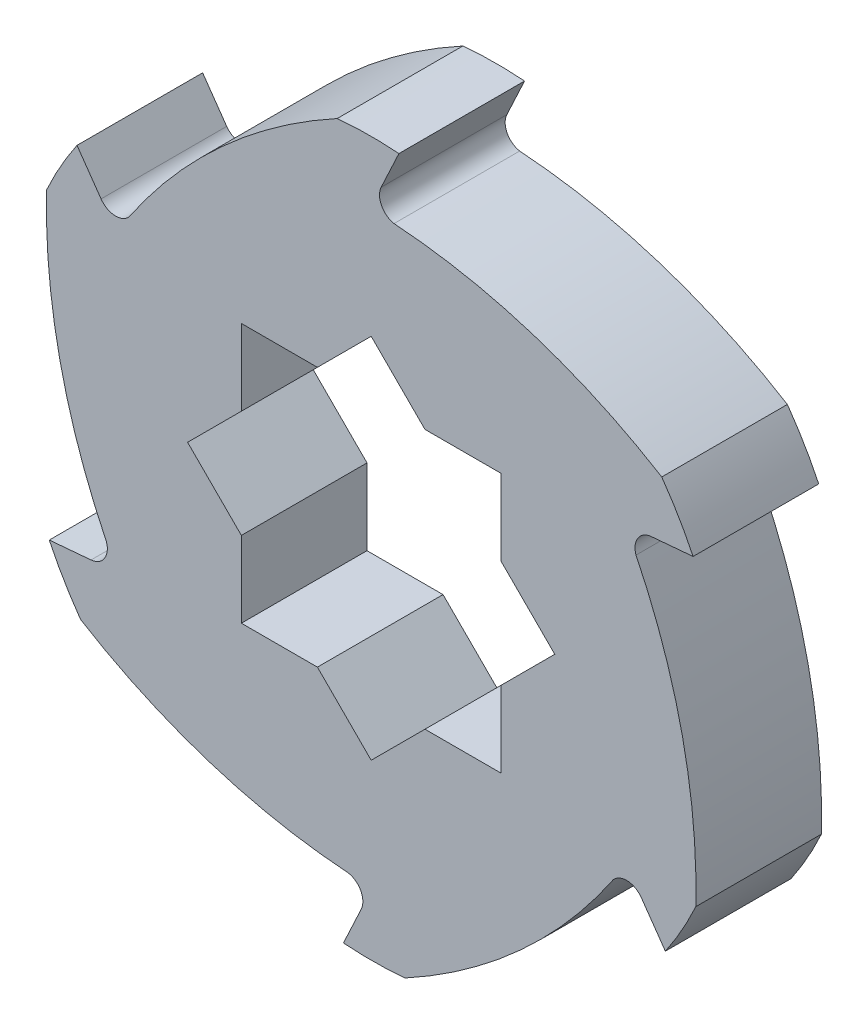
ISO-10303-21;
HEADER;
FILE_DESCRIPTION(('STEP AP214'),'2;1');
FILE_NAME('part.step','',(''),(''),'','','');
FILE_SCHEMA(('AUTOMOTIVE_DESIGN { 1 0 10303 214 1 1 1 1 }'));
ENDSEC;
DATA;
#1=APPLICATION_CONTEXT('core data for automotive mechanical design processes');
#2=APPLICATION_PROTOCOL_DEFINITION('international standard','automotive_design',2000,#1);
#3=PRODUCT_CONTEXT('',#1,'mechanical');
#4=PRODUCT('Part','Part','',(#3));
#5=PRODUCT_RELATED_PRODUCT_CATEGORY('part','',(#4));
#6=PRODUCT_DEFINITION_FORMATION('','',#4);
#7=PRODUCT_DEFINITION_CONTEXT('part definition',#1,'design');
#8=PRODUCT_DEFINITION('design','',#6,#7);
#9=PRODUCT_DEFINITION_SHAPE('','',#8);
#10=(LENGTH_UNIT() NAMED_UNIT(*) SI_UNIT(.MILLI.,.METRE.));
#11=(NAMED_UNIT(*) PLANE_ANGLE_UNIT() SI_UNIT($,.RADIAN.));
#12=(NAMED_UNIT(*) SI_UNIT($,.STERADIAN.) SOLID_ANGLE_UNIT());
#13=UNCERTAINTY_MEASURE_WITH_UNIT(LENGTH_MEASURE(1.E-05),#10,'distance_accuracy_value','');
#14=(GEOMETRIC_REPRESENTATION_CONTEXT(3) GLOBAL_UNCERTAINTY_ASSIGNED_CONTEXT((#13)) GLOBAL_UNIT_ASSIGNED_CONTEXT((#10,
#11,#12)) REPRESENTATION_CONTEXT('',''));
#15=CARTESIAN_POINT('',(0.,0.,0.));
#16=DIRECTION('',(0.,0.,1.));
#17=DIRECTION('',(1.,0.,0.));
#18=AXIS2_PLACEMENT_3D('',#15,#16,#17);
#19=CARTESIAN_POINT('',(31.8272298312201,15.8658832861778,13.95));
#20=DIRECTION('',(0.,0.,-1.));
#21=DIRECTION('',(-1.,0.,0.));
#22=AXIS2_PLACEMENT_3D('',#19,#20,#21);
#23=CYLINDRICAL_SURFACE('',#22,70.6060747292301);
#24=CARTESIAN_POINT('',(31.8272298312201,15.8658832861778,-1.05));
#25=DIRECTION('',(0.,0.,-1.));
#26=DIRECTION('',(1.,0.,0.));
#27=AXIS2_PLACEMENT_3D('',#24,#25,#26);
#28=CIRCLE('',#27,70.6060747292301);
#29=CARTESIAN_POINT('',(-31.6225445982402,-15.1073941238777,-1.05));
#30=VERTEX_POINT('',#29);
#31=CARTESIAN_POINT('',(-38.7553920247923,17.6855757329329,-1.05));
#32=VERTEX_POINT('',#31);
#33=EDGE_CURVE('E436',#30,#32,#28,.T.);
#34=ORIENTED_EDGE('',*,*,#33,.F.);
#35=DIRECTION('',(0.,0.,-1.));
#36=VECTOR('',#35,1.);
#37=CARTESIAN_POINT('',(-31.6225445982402,-15.1073941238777,13.95));
#38=LINE('',#37,#36);
#39=CARTESIAN_POINT('',(-31.6225445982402,-15.1073941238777,13.95));
#40=VERTEX_POINT('',#39);
#41=EDGE_CURVE('E11',#40,#30,#38,.T.);
#42=ORIENTED_EDGE('',*,*,#41,.F.);
#43=CARTESIAN_POINT('',(31.8272298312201,15.8658832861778,13.95));
#44=DIRECTION('',(0.,0.,-1.));
#45=DIRECTION('',(1.,0.,0.));
#46=AXIS2_PLACEMENT_3D('',#43,#44,#45);
#47=CIRCLE('',#46,70.6060747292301);
#48=CARTESIAN_POINT('',(-38.7553920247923,17.6855757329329,13.95));
#49=VERTEX_POINT('',#48);
#50=EDGE_CURVE('E478',#40,#49,#47,.T.);
#51=ORIENTED_EDGE('',*,*,#50,.T.);
#52=DIRECTION('',(0.,0.,-1.));
#53=VECTOR('',#52,1.);
#54=CARTESIAN_POINT('',(-38.7553920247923,17.6855757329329,13.95));
#55=LINE('',#54,#53);
#56=EDGE_CURVE('E41',#49,#32,#55,.T.);
#57=ORIENTED_EDGE('',*,*,#56,.T.);
#58=EDGE_LOOP('',(#34,#42,#51,#57));
#59=FACE_BOUND('',#58,.T.);
#60=ADVANCED_FACE('F38',(#59),#23,.T.);
#61=CARTESIAN_POINT('',(-33.6333288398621,-15.8099941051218,13.95));
#62=DIRECTION('',(0.,0.,-1.));
#63=DIRECTION('',(-1.,0.,0.));
#64=AXIS2_PLACEMENT_3D('',#61,#62,#63);
#65=CYLINDRICAL_SURFACE('',#64,2.12999999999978);
#66=CARTESIAN_POINT('',(-33.6333288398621,-15.8099941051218,-1.05));
#67=DIRECTION('',(0.,0.,1.));
#68=DIRECTION('',(1.,0.,0.));
#69=AXIS2_PLACEMENT_3D('',#66,#67,#68);
#70=CIRCLE('',#69,2.12999999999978);
#71=CARTESIAN_POINT('',(-33.4476871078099,-17.931888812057,-1.05));
#72=VERTEX_POINT('',#71);
#73=EDGE_CURVE('E483',#72,#30,#70,.T.);
#74=ORIENTED_EDGE('',*,*,#73,.F.);
#75=DIRECTION('',(0.,0.,-1.));
#76=VECTOR('',#75,1.);
#77=CARTESIAN_POINT('',(-33.4476871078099,-17.931888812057,13.95));
#78=LINE('',#77,#76);
#79=CARTESIAN_POINT('',(-33.4476871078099,-17.931888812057,13.95));
#80=VERTEX_POINT('',#79);
#81=EDGE_CURVE('E47',#80,#72,#78,.T.);
#82=ORIENTED_EDGE('',*,*,#81,.F.);
#83=CARTESIAN_POINT('',(-33.6333288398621,-15.8099941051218,13.95));
#84=DIRECTION('',(0.,0.,1.));
#85=DIRECTION('',(1.,0.,0.));
#86=AXIS2_PLACEMENT_3D('',#83,#84,#85);
#87=CIRCLE('',#86,2.12999999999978);
#88=EDGE_CURVE('E571',#80,#40,#87,.T.);
#89=ORIENTED_EDGE('',*,*,#88,.T.);
#90=ORIENTED_EDGE('',*,*,#41,.T.);
#91=EDGE_LOOP('',(#74,#82,#89,#90));
#92=FACE_BOUND('',#91,.T.);
#93=ADVANCED_FACE('F745',(#92),#65,.F.);
#94=CARTESIAN_POINT('',(-38.4364882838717,-18.3683523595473,13.95));
#95=DIRECTION('',(-0.087155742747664,0.996194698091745,0.));
#96=DIRECTION('',(-0.996194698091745,-0.087155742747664,0.));
#97=AXIS2_PLACEMENT_3D('',#94,#95,#96);
#98=PLANE('',#97);
#99=DIRECTION('',(0.996194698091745,0.087155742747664,0.));
#100=VECTOR('',#99,1.);
#101=CARTESIAN_POINT('',(-38.4364882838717,-18.3683523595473,-1.05));
#102=LINE('',#101,#100);
#103=CARTESIAN_POINT('',(-38.4364882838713,-18.3683523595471,-1.05));
#104=VERTEX_POINT('',#103);
#105=EDGE_CURVE('E661',#104,#72,#102,.T.);
#106=ORIENTED_EDGE('',*,*,#105,.F.);
#107=DIRECTION('',(0.,0.,-1.));
#108=VECTOR('',#107,1.);
#109=CARTESIAN_POINT('',(-38.4364882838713,-18.3683523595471,13.95));
#110=LINE('',#109,#108);
#111=CARTESIAN_POINT('',(-38.4364882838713,-18.3683523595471,13.95));
#112=VERTEX_POINT('',#111);
#113=EDGE_CURVE('E670',#112,#104,#110,.T.);
#114=ORIENTED_EDGE('',*,*,#113,.F.);
#115=DIRECTION('',(0.996194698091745,0.087155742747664,0.));
#116=VECTOR('',#115,1.);
#117=CARTESIAN_POINT('',(-38.4364882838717,-18.3683523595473,13.95));
#118=LINE('',#117,#116);
#119=EDGE_CURVE('E567',#112,#80,#118,.T.);
#120=ORIENTED_EDGE('',*,*,#119,.T.);
#121=ORIENTED_EDGE('',*,*,#81,.T.);
#122=EDGE_LOOP('',(#106,#114,#120,#121));
#123=FACE_BOUND('',#122,.T.);
#124=ADVANCED_FACE('F828',(#123),#98,.T.);
#125=CARTESIAN_POINT('',(-1.17881124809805E-13,0.,13.95));
#126=DIRECTION('',(0.,0.,-1.));
#127=DIRECTION('',(-1.,0.,0.));
#128=AXIS2_PLACEMENT_3D('',#125,#126,#127);
#129=CYLINDRICAL_SURFACE('',#128,42.6000000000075);
#130=CARTESIAN_POINT('',(-1.17881124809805E-13,0.,-1.05));
#131=DIRECTION('',(0.,0.,-1.));
#132=DIRECTION('',(-1.,0.,0.));
#133=AXIS2_PLACEMENT_3D('',#130,#131,#132);
#134=CIRCLE('',#133,42.6000000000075);
#135=CARTESIAN_POINT('',(-34.6938538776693,-24.7203661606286,-1.05));
#136=VERTEX_POINT('',#135);
#137=EDGE_CURVE('E657',#136,#104,#134,.T.);
#138=ORIENTED_EDGE('',*,*,#137,.F.);
#139=DIRECTION('',(0.,0.,-1.));
#140=VECTOR('',#139,1.);
#141=CARTESIAN_POINT('',(-34.6938538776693,-24.7203661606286,13.95));
#142=LINE('',#141,#140);
#143=CARTESIAN_POINT('',(-34.6938538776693,-24.7203661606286,13.95));
#144=VERTEX_POINT('',#143);
#145=EDGE_CURVE('E673',#144,#136,#142,.T.);
#146=ORIENTED_EDGE('',*,*,#145,.F.);
#147=CARTESIAN_POINT('',(-1.17881124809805E-13,0.,13.95));
#148=DIRECTION('',(0.,0.,-1.));
#149=DIRECTION('',(-1.,0.,0.));
#150=AXIS2_PLACEMENT_3D('',#147,#148,#149);
#151=CIRCLE('',#150,42.6000000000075);
#152=EDGE_CURVE('E563',#144,#112,#151,.T.);
#153=ORIENTED_EDGE('',*,*,#152,.T.);
#154=ORIENTED_EDGE('',*,*,#113,.T.);
#155=EDGE_LOOP('',(#138,#146,#153,#154));
#156=FACE_BOUND('',#155,.T.);
#157=ADVANCED_FACE('F825',(#156),#129,.T.);
#158=CARTESIAN_POINT('',(2.17335693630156,35.4961312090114,13.95));
#159=DIRECTION('',(0.,0.,-1.));
#160=DIRECTION('',(-1.,0.,0.));
#161=AXIS2_PLACEMENT_3D('',#158,#159,#160);
#162=CYLINDRICAL_SURFACE('',#161,70.6060747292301);
#163=CARTESIAN_POINT('',(2.17335693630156,35.4961312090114,-1.05));
#164=DIRECTION('',(0.,0.,-1.));
#165=DIRECTION('',(1.,0.,0.));
#166=AXIS2_PLACEMENT_3D('',#163,#164,#165);
#167=CIRCLE('',#166,70.6060747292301);
#168=CARTESIAN_POINT('',(-2.72788520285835,-34.9396240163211,-1.05));
#169=VERTEX_POINT('',#168);
#170=EDGE_CURVE('E653',#169,#136,#167,.T.);
#171=ORIENTED_EDGE('',*,*,#170,.F.);
#172=DIRECTION('',(0.,0.,-1.));
#173=VECTOR('',#172,1.);
#174=CARTESIAN_POINT('',(-2.72788520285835,-34.9396240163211,13.95));
#175=LINE('',#174,#173);
#176=CARTESIAN_POINT('',(-2.72788520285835,-34.9396240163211,13.95));
#177=VERTEX_POINT('',#176);
#178=EDGE_CURVE('E676',#177,#169,#175,.T.);
#179=ORIENTED_EDGE('',*,*,#178,.F.);
#180=CARTESIAN_POINT('',(2.17335693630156,35.4961312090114,13.95));
#181=DIRECTION('',(0.,0.,-1.));
#182=DIRECTION('',(1.,0.,0.));
#183=AXIS2_PLACEMENT_3D('',#180,#181,#182);
#184=CIRCLE('',#183,70.6060747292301);
#185=EDGE_CURVE('E559',#177,#144,#184,.T.);
#186=ORIENTED_EDGE('',*,*,#185,.T.);
#187=ORIENTED_EDGE('',*,*,#145,.T.);
#188=EDGE_LOOP('',(#171,#179,#186,#187));
#189=FACE_BOUND('',#188,.T.);
#190=ADVANCED_FACE('F822',(#189),#162,.T.);
#191=CARTESIAN_POINT('',(-3.12480789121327,-37.0323142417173,13.95));
#192=DIRECTION('',(0.,0.,-1.));
#193=DIRECTION('',(-1.,0.,0.));
#194=AXIS2_PLACEMENT_3D('',#191,#192,#193);
#195=CYLINDRICAL_SURFACE('',#194,2.12999999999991);
#196=CARTESIAN_POINT('',(-3.12480789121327,-37.0323142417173,-1.05));
#197=DIRECTION('',(0.,0.,1.));
#198=DIRECTION('',(1.,0.,0.));
#199=AXIS2_PLACEMENT_3D('',#196,#197,#198);
#200=CIRCLE('',#199,2.12999999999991);
#201=CARTESIAN_POINT('',(-1.1943723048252,-37.932491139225,-1.05));
#202=VERTEX_POINT('',#201);
#203=EDGE_CURVE('E649',#202,#169,#200,.T.);
#204=ORIENTED_EDGE('',*,*,#203,.F.);
#205=DIRECTION('',(0.,0.,-1.));
#206=VECTOR('',#205,1.);
#207=CARTESIAN_POINT('',(-1.1943723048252,-37.932491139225,13.95));
#208=LINE('',#207,#206);
#209=CARTESIAN_POINT('',(-1.1943723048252,-37.932491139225,13.95));
#210=VERTEX_POINT('',#209);
#211=EDGE_CURVE('E679',#210,#202,#208,.T.);
#212=ORIENTED_EDGE('',*,*,#211,.F.);
#213=CARTESIAN_POINT('',(-3.12480789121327,-37.0323142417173,13.95));
#214=DIRECTION('',(0.,0.,1.));
#215=DIRECTION('',(1.,0.,0.));
#216=AXIS2_PLACEMENT_3D('',#213,#214,#215);
#217=CIRCLE('',#216,2.12999999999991);
#218=EDGE_CURVE('E555',#210,#177,#217,.T.);
#219=ORIENTED_EDGE('',*,*,#218,.T.);
#220=ORIENTED_EDGE('',*,*,#178,.T.);
#221=EDGE_LOOP('',(#204,#212,#219,#220));
#222=FACE_BOUND('',#221,.T.);
#223=ADVANCED_FACE('F818',(#222),#195,.F.);
#224=CARTESIAN_POINT('',(-3.31078437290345,-42.4711514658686,13.95));
#225=DIRECTION('',(-0.906307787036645,0.422618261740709,0.));
#226=DIRECTION('',(-0.422618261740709,-0.906307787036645,0.));
#227=AXIS2_PLACEMENT_3D('',#224,#225,#226);
#228=PLANE('',#227);
#229=DIRECTION('',(0.422618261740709,0.906307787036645,0.));
#230=VECTOR('',#229,1.);
#231=CARTESIAN_POINT('',(-3.31078437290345,-42.4711514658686,-1.05));
#232=LINE('',#231,#230);
#233=CARTESIAN_POINT('',(-3.31078437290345,-42.4711514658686,-1.05));
#234=VERTEX_POINT('',#233);
#235=EDGE_CURVE('E645',#234,#202,#232,.T.);
#236=ORIENTED_EDGE('',*,*,#235,.F.);
#237=DIRECTION('',(0.,0.,-1.));
#238=VECTOR('',#237,1.);
#239=CARTESIAN_POINT('',(-3.31078437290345,-42.4711514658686,13.95));
#240=LINE('',#239,#238);
#241=CARTESIAN_POINT('',(-3.31078437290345,-42.4711514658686,13.95));
#242=VERTEX_POINT('',#241);
#243=EDGE_CURVE('E682',#242,#234,#240,.T.);
#244=ORIENTED_EDGE('',*,*,#243,.F.);
#245=DIRECTION('',(0.422618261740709,0.906307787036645,0.));
#246=VECTOR('',#245,1.);
#247=CARTESIAN_POINT('',(-3.31078437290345,-42.4711514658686,13.95));
#248=LINE('',#247,#246);
#249=EDGE_CURVE('E551',#242,#210,#248,.T.);
#250=ORIENTED_EDGE('',*,*,#249,.T.);
#251=ORIENTED_EDGE('',*,*,#211,.T.);
#252=EDGE_LOOP('',(#236,#244,#250,#251));
#253=FACE_BOUND('',#252,.T.);
#254=ADVANCED_FACE('F814',(#253),#228,.T.);
#255=CARTESIAN_POINT('',(-1.17881124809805E-13,0.,13.95));
#256=DIRECTION('',(0.,0.,-1.));
#257=DIRECTION('',(-1.,0.,0.));
#258=AXIS2_PLACEMENT_3D('',#255,#256,#257);
#259=CYLINDRICAL_SURFACE('',#258,42.6000000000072);
#260=CARTESIAN_POINT('',(-1.17881124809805E-13,0.,-1.05));
#261=DIRECTION('',(0.,0.,-1.));
#262=DIRECTION('',(-1.,0.,0.));
#263=AXIS2_PLACEMENT_3D('',#260,#261,#262);
#264=CIRCLE('',#263,42.6000000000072);
#265=CARTESIAN_POINT('',(4.06153814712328,-42.4059418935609,-1.05));
#266=VERTEX_POINT('',#265);
#267=EDGE_CURVE('E641',#266,#234,#264,.T.);
#268=ORIENTED_EDGE('',*,*,#267,.F.);
#269=DIRECTION('',(0.,0.,-1.));
#270=VECTOR('',#269,1.);
#271=CARTESIAN_POINT('',(4.06153814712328,-42.4059418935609,13.95));
#272=LINE('',#271,#270);
#273=CARTESIAN_POINT('',(4.06153814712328,-42.4059418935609,13.95));
#274=VERTEX_POINT('',#273);
#275=EDGE_CURVE('E685',#274,#266,#272,.T.);
#276=ORIENTED_EDGE('',*,*,#275,.F.);
#277=CARTESIAN_POINT('',(-1.17881124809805E-13,0.,13.95));
#278=DIRECTION('',(0.,0.,-1.));
#279=DIRECTION('',(-1.,0.,0.));
#280=AXIS2_PLACEMENT_3D('',#277,#278,#279);
#281=CIRCLE('',#280,42.6000000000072);
#282=EDGE_CURVE('E547',#274,#242,#281,.T.);
#283=ORIENTED_EDGE('',*,*,#282,.T.);
#284=ORIENTED_EDGE('',*,*,#243,.T.);
#285=EDGE_LOOP('',(#268,#276,#283,#284));
#286=FACE_BOUND('',#285,.T.);
#287=ADVANCED_FACE('F810',(#286),#259,.T.);
#288=CARTESIAN_POINT('',(-29.6538728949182,19.6302479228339,13.95));
#289=DIRECTION('',(0.,0.,-1.));
#290=DIRECTION('',(-1.,0.,0.));
#291=AXIS2_PLACEMENT_3D('',#288,#289,#290);
#292=CYLINDRICAL_SURFACE('',#291,70.6060747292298);
#293=CARTESIAN_POINT('',(-29.6538728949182,19.6302479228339,-1.05));
#294=DIRECTION('',(0.,0.,-1.));
#295=DIRECTION('',(1.,0.,0.));
#296=AXIS2_PLACEMENT_3D('',#293,#294,#295);
#297=CIRCLE('',#296,70.6060747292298);
#298=CARTESIAN_POINT('',(28.8946593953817,-19.8322298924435,-1.05));
#299=VERTEX_POINT('',#298);
#300=EDGE_CURVE('E637',#299,#266,#297,.T.);
#301=ORIENTED_EDGE('',*,*,#300,.F.);
#302=DIRECTION('',(0.,0.,-1.));
#303=VECTOR('',#302,1.);
#304=CARTESIAN_POINT('',(28.8946593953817,-19.8322298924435,13.95));
#305=LINE('',#304,#303);
#306=CARTESIAN_POINT('',(28.8946593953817,-19.8322298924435,13.95));
#307=VERTEX_POINT('',#306);
#308=EDGE_CURVE('E688',#307,#299,#305,.T.);
#309=ORIENTED_EDGE('',*,*,#308,.F.);
#310=CARTESIAN_POINT('',(-29.6538728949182,19.6302479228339,13.95));
#311=DIRECTION('',(0.,0.,-1.));
#312=DIRECTION('',(1.,0.,0.));
#313=AXIS2_PLACEMENT_3D('',#310,#311,#312);
#314=CIRCLE('',#313,70.6060747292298);
#315=EDGE_CURVE('E543',#307,#274,#314,.T.);
#316=ORIENTED_EDGE('',*,*,#315,.T.);
#317=ORIENTED_EDGE('',*,*,#275,.T.);
#318=EDGE_LOOP('',(#301,#309,#316,#317));
#319=FACE_BOUND('',#318,.T.);
#320=ADVANCED_FACE('F806',(#319),#292,.T.);
#321=CARTESIAN_POINT('',(30.5085209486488,-21.2223201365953,13.95));
#322=DIRECTION('',(0.,0.,-1.));
#323=DIRECTION('',(-1.,0.,0.));
#324=AXIS2_PLACEMENT_3D('',#321,#322,#323);
#325=CYLINDRICAL_SURFACE('',#324,2.12999999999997);
#326=CARTESIAN_POINT('',(30.5085209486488,-21.2223201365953,-1.05));
#327=DIRECTION('',(0.,0.,1.));
#328=DIRECTION('',(1.,0.,0.));
#329=AXIS2_PLACEMENT_3D('',#326,#327,#328);
#330=CIRCLE('',#329,2.12999999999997);
#331=CARTESIAN_POINT('',(32.2533148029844,-20.0006023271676,-1.05));
#332=VERTEX_POINT('',#331);
#333=EDGE_CURVE('E633',#332,#299,#330,.T.);
#334=ORIENTED_EDGE('',*,*,#333,.F.);
#335=DIRECTION('',(0.,0.,-1.));
#336=VECTOR('',#335,1.);
#337=CARTESIAN_POINT('',(32.2533148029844,-20.0006023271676,13.95));
#338=LINE('',#337,#336);
#339=CARTESIAN_POINT('',(32.2533148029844,-20.0006023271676,13.95));
#340=VERTEX_POINT('',#339);
#341=EDGE_CURVE('E691',#340,#332,#338,.T.);
#342=ORIENTED_EDGE('',*,*,#341,.F.);
#343=CARTESIAN_POINT('',(30.5085209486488,-21.2223201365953,13.95));
#344=DIRECTION('',(0.,0.,1.));
#345=DIRECTION('',(1.,0.,0.));
#346=AXIS2_PLACEMENT_3D('',#343,#344,#345);
#347=CIRCLE('',#346,2.12999999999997);
#348=EDGE_CURVE('E539',#340,#307,#347,.T.);
#349=ORIENTED_EDGE('',*,*,#348,.T.);
#350=ORIENTED_EDGE('',*,*,#308,.T.);
#351=EDGE_LOOP('',(#334,#342,#349,#350));
#352=FACE_BOUND('',#351,.T.);
#353=ADVANCED_FACE('F802',(#352),#325,.F.);
#354=CARTESIAN_POINT('',(35.1257039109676,-24.1027991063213,13.95));
#355=DIRECTION('',(-0.819152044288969,-0.573576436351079,0.));
#356=DIRECTION('',(0.573576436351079,-0.819152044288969,0.));
#357=AXIS2_PLACEMENT_3D('',#354,#355,#356);
#358=PLANE('',#357);
#359=DIRECTION('',(-0.573576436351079,0.819152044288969,0.));
#360=VECTOR('',#359,1.);
#361=CARTESIAN_POINT('',(35.1257039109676,-24.1027991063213,-1.05));
#362=LINE('',#361,#360);
#363=CARTESIAN_POINT('',(35.1257039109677,-24.1027991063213,-1.05));
#364=VERTEX_POINT('',#363);
#365=EDGE_CURVE('E629',#364,#332,#362,.T.);
#366=ORIENTED_EDGE('',*,*,#365,.F.);
#367=DIRECTION('',(0.,0.,-1.));
#368=VECTOR('',#367,1.);
#369=CARTESIAN_POINT('',(35.1257039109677,-24.1027991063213,13.95));
#370=LINE('',#369,#368);
#371=CARTESIAN_POINT('',(35.1257039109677,-24.1027991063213,13.95));
#372=VERTEX_POINT('',#371);
#373=EDGE_CURVE('E694',#372,#364,#370,.T.);
#374=ORIENTED_EDGE('',*,*,#373,.F.);
#375=DIRECTION('',(-0.573576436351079,0.819152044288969,0.));
#376=VECTOR('',#375,1.);
#377=CARTESIAN_POINT('',(35.1257039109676,-24.1027991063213,13.95));
#378=LINE('',#377,#376);
#379=EDGE_CURVE('E535',#372,#340,#378,.T.);
#380=ORIENTED_EDGE('',*,*,#379,.T.);
#381=ORIENTED_EDGE('',*,*,#341,.T.);
#382=EDGE_LOOP('',(#366,#374,#380,#381));
#383=FACE_BOUND('',#382,.T.);
#384=ADVANCED_FACE('F798',(#383),#358,.T.);
#385=CARTESIAN_POINT('',(-1.17881124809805E-13,0.,13.95));
#386=DIRECTION('',(0.,0.,-1.));
#387=DIRECTION('',(-1.,0.,0.));
#388=AXIS2_PLACEMENT_3D('',#385,#386,#387);
#389=CYLINDRICAL_SURFACE('',#388,42.6000000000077);
#390=CARTESIAN_POINT('',(-1.17881124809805E-13,0.,-1.05));
#391=DIRECTION('',(0.,0.,-1.));
#392=DIRECTION('',(-1.,0.,0.));
#393=AXIS2_PLACEMENT_3D('',#390,#391,#392);
#394=CIRCLE('',#393,42.6000000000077);
#395=CARTESIAN_POINT('',(38.7553920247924,-17.6855757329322,-1.05));
#396=VERTEX_POINT('',#395);
#397=EDGE_CURVE('E625',#396,#364,#394,.T.);
#398=ORIENTED_EDGE('',*,*,#397,.F.);
#399=DIRECTION('',(0.,0.,-1.));
#400=VECTOR('',#399,1.);
#401=CARTESIAN_POINT('',(38.7553920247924,-17.6855757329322,13.95));
#402=LINE('',#401,#400);
#403=CARTESIAN_POINT('',(38.7553920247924,-17.6855757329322,13.95));
#404=VERTEX_POINT('',#403);
#405=EDGE_CURVE('E697',#404,#396,#402,.T.);
#406=ORIENTED_EDGE('',*,*,#405,.F.);
#407=CARTESIAN_POINT('',(-1.17881124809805E-13,0.,13.95));
#408=DIRECTION('',(0.,0.,-1.));
#409=DIRECTION('',(-1.,0.,0.));
#410=AXIS2_PLACEMENT_3D('',#407,#408,#409);
#411=CIRCLE('',#410,42.6000000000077);
#412=EDGE_CURVE('E531',#404,#372,#411,.T.);
#413=ORIENTED_EDGE('',*,*,#412,.T.);
#414=ORIENTED_EDGE('',*,*,#373,.T.);
#415=EDGE_LOOP('',(#398,#406,#413,#414));
#416=FACE_BOUND('',#415,.T.);
#417=ADVANCED_FACE('F794',(#416),#389,.T.);
#418=CARTESIAN_POINT('',(-31.8272298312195,-15.8658832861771,13.95));
#419=DIRECTION('',(0.,0.,-1.));
#420=DIRECTION('',(-1.,0.,0.));
#421=AXIS2_PLACEMENT_3D('',#418,#419,#420);
#422=CYLINDRICAL_SURFACE('',#421,70.6060747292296);
#423=CARTESIAN_POINT('',(-31.8272298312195,-15.8658832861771,-1.05));
#424=DIRECTION('',(0.,0.,-1.));
#425=DIRECTION('',(1.,0.,0.));
#426=AXIS2_PLACEMENT_3D('',#423,#424,#425);
#427=CIRCLE('',#426,70.6060747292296);
#428=CARTESIAN_POINT('',(31.62254459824,15.1073941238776,-1.05));
#429=VERTEX_POINT('',#428);
#430=EDGE_CURVE('E621',#429,#396,#427,.T.);
#431=ORIENTED_EDGE('',*,*,#430,.F.);
#432=DIRECTION('',(0.,0.,-1.));
#433=VECTOR('',#432,1.);
#434=CARTESIAN_POINT('',(31.62254459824,15.1073941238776,13.95));
#435=LINE('',#434,#433);
#436=CARTESIAN_POINT('',(31.62254459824,15.1073941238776,13.95));
#437=VERTEX_POINT('',#436);
#438=EDGE_CURVE('E700',#437,#429,#435,.T.);
#439=ORIENTED_EDGE('',*,*,#438,.F.);
#440=CARTESIAN_POINT('',(-31.8272298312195,-15.8658832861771,13.95));
#441=DIRECTION('',(0.,0.,-1.));
#442=DIRECTION('',(1.,0.,0.));
#443=AXIS2_PLACEMENT_3D('',#440,#441,#442);
#444=CIRCLE('',#443,70.6060747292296);
#445=EDGE_CURVE('E527',#437,#404,#444,.T.);
#446=ORIENTED_EDGE('',*,*,#445,.T.);
#447=ORIENTED_EDGE('',*,*,#405,.T.);
#448=EDGE_LOOP('',(#431,#439,#446,#447));
#449=FACE_BOUND('',#448,.T.);
#450=ADVANCED_FACE('F790',(#449),#422,.T.);
#451=CARTESIAN_POINT('',(33.633328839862,15.809994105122,13.95));
#452=DIRECTION('',(0.,0.,-1.));
#453=DIRECTION('',(-1.,0.,0.));
#454=AXIS2_PLACEMENT_3D('',#451,#452,#453);
#455=CYLINDRICAL_SURFACE('',#454,2.13);
#456=CARTESIAN_POINT('',(33.633328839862,15.809994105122,-1.05));
#457=DIRECTION('',(0.,0.,1.));
#458=DIRECTION('',(1.,0.,0.));
#459=AXIS2_PLACEMENT_3D('',#456,#457,#458);
#460=CIRCLE('',#459,2.13);
#461=CARTESIAN_POINT('',(33.4476871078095,17.9318888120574,-1.05));
#462=VERTEX_POINT('',#461);
#463=EDGE_CURVE('E617',#462,#429,#460,.T.);
#464=ORIENTED_EDGE('',*,*,#463,.F.);
#465=DIRECTION('',(0.,0.,-1.));
#466=VECTOR('',#465,1.);
#467=CARTESIAN_POINT('',(33.4476871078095,17.9318888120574,13.95));
#468=LINE('',#467,#466);
#469=CARTESIAN_POINT('',(33.4476871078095,17.9318888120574,13.95));
#470=VERTEX_POINT('',#469);
#471=EDGE_CURVE('E703',#470,#462,#468,.T.);
#472=ORIENTED_EDGE('',*,*,#471,.F.);
#473=CARTESIAN_POINT('',(33.633328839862,15.809994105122,13.95));
#474=DIRECTION('',(0.,0.,1.));
#475=DIRECTION('',(1.,0.,0.));
#476=AXIS2_PLACEMENT_3D('',#473,#474,#475);
#477=CIRCLE('',#476,2.13);
#478=EDGE_CURVE('E523',#470,#437,#477,.T.);
#479=ORIENTED_EDGE('',*,*,#478,.T.);
#480=ORIENTED_EDGE('',*,*,#438,.T.);
#481=EDGE_LOOP('',(#464,#472,#479,#480));
#482=FACE_BOUND('',#481,.T.);
#483=ADVANCED_FACE('F786',(#482),#455,.F.);
#484=CARTESIAN_POINT('',(38.4364882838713,18.3683523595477,13.95));
#485=DIRECTION('',(0.0871557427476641,-0.996194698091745,0.));
#486=DIRECTION('',(0.996194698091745,0.0871557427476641,0.));
#487=AXIS2_PLACEMENT_3D('',#484,#485,#486);
#488=PLANE('',#487);
#489=DIRECTION('',(-0.996194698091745,-0.0871557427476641,0.));
#490=VECTOR('',#489,1.);
#491=CARTESIAN_POINT('',(38.4364882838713,18.3683523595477,-1.05));
#492=LINE('',#491,#490);
#493=CARTESIAN_POINT('',(38.4364882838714,18.3683523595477,-1.05));
#494=VERTEX_POINT('',#493);
#495=EDGE_CURVE('E613',#494,#462,#492,.T.);
#496=ORIENTED_EDGE('',*,*,#495,.F.);
#497=DIRECTION('',(0.,0.,-1.));
#498=VECTOR('',#497,1.);
#499=CARTESIAN_POINT('',(38.4364882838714,18.3683523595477,13.95));
#500=LINE('',#499,#498);
#501=CARTESIAN_POINT('',(38.4364882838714,18.3683523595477,13.95));
#502=VERTEX_POINT('',#501);
#503=EDGE_CURVE('E706',#502,#494,#500,.T.);
#504=ORIENTED_EDGE('',*,*,#503,.F.);
#505=DIRECTION('',(-0.996194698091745,-0.0871557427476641,0.));
#506=VECTOR('',#505,1.);
#507=CARTESIAN_POINT('',(38.4364882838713,18.3683523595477,13.95));
#508=LINE('',#507,#506);
#509=EDGE_CURVE('E519',#502,#470,#508,.T.);
#510=ORIENTED_EDGE('',*,*,#509,.T.);
#511=ORIENTED_EDGE('',*,*,#471,.T.);
#512=EDGE_LOOP('',(#496,#504,#510,#511));
#513=FACE_BOUND('',#512,.T.);
#514=ADVANCED_FACE('F782',(#513),#488,.T.);
#515=CARTESIAN_POINT('',(-1.17881124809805E-13,0.,13.95));
#516=DIRECTION('',(0.,0.,-1.));
#517=DIRECTION('',(-1.,0.,0.));
#518=AXIS2_PLACEMENT_3D('',#515,#516,#517);
#519=CYLINDRICAL_SURFACE('',#518,42.6000000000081);
#520=CARTESIAN_POINT('',(-1.17881124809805E-13,0.,-1.05));
#521=DIRECTION('',(0.,0.,-1.));
#522=DIRECTION('',(-1.,0.,0.));
#523=AXIS2_PLACEMENT_3D('',#520,#521,#522);
#524=CIRCLE('',#523,42.6000000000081);
#525=CARTESIAN_POINT('',(34.6938538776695,24.720366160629,-1.05));
#526=VERTEX_POINT('',#525);
#527=EDGE_CURVE('E609',#526,#494,#524,.T.);
#528=ORIENTED_EDGE('',*,*,#527,.F.);
#529=DIRECTION('',(0.,0.,-1.));
#530=VECTOR('',#529,1.);
#531=CARTESIAN_POINT('',(34.6938538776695,24.720366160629,13.95));
#532=LINE('',#531,#530);
#533=CARTESIAN_POINT('',(34.6938538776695,24.720366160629,13.95));
#534=VERTEX_POINT('',#533);
#535=EDGE_CURVE('E709',#534,#526,#532,.T.);
#536=ORIENTED_EDGE('',*,*,#535,.F.);
#537=CARTESIAN_POINT('',(-1.17881124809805E-13,0.,13.95));
#538=DIRECTION('',(0.,0.,-1.));
#539=DIRECTION('',(-1.,0.,0.));
#540=AXIS2_PLACEMENT_3D('',#537,#538,#539);
#541=CIRCLE('',#540,42.6000000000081);
#542=EDGE_CURVE('E515',#534,#502,#541,.T.);
#543=ORIENTED_EDGE('',*,*,#542,.T.);
#544=ORIENTED_EDGE('',*,*,#503,.T.);
#545=EDGE_LOOP('',(#528,#536,#543,#544));
#546=FACE_BOUND('',#545,.T.);
#547=ADVANCED_FACE('F778',(#546),#519,.T.);
#548=CARTESIAN_POINT('',(-2.17335693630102,-35.4961312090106,13.95));
#549=DIRECTION('',(0.,0.,-1.));
#550=DIRECTION('',(-1.,0.,0.));
#551=AXIS2_PLACEMENT_3D('',#548,#549,#550);
#552=CYLINDRICAL_SURFACE('',#551,70.6060747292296);
#553=CARTESIAN_POINT('',(-2.17335693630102,-35.4961312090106,-1.05));
#554=DIRECTION('',(0.,0.,-1.));
#555=DIRECTION('',(1.,0.,0.));
#556=AXIS2_PLACEMENT_3D('',#553,#554,#555);
#557=CIRCLE('',#556,70.6060747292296);
#558=CARTESIAN_POINT('',(2.72788520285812,34.9396240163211,-1.05));
#559=VERTEX_POINT('',#558);
#560=EDGE_CURVE('E605',#559,#526,#557,.T.);
#561=ORIENTED_EDGE('',*,*,#560,.F.);
#562=DIRECTION('',(0.,0.,-1.));
#563=VECTOR('',#562,1.);
#564=CARTESIAN_POINT('',(2.72788520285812,34.9396240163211,13.95));
#565=LINE('',#564,#563);
#566=CARTESIAN_POINT('',(2.72788520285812,34.9396240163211,13.95));
#567=VERTEX_POINT('',#566);
#568=EDGE_CURVE('E712',#567,#559,#565,.T.);
#569=ORIENTED_EDGE('',*,*,#568,.F.);
#570=CARTESIAN_POINT('',(-2.17335693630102,-35.4961312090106,13.95));
#571=DIRECTION('',(0.,0.,-1.));
#572=DIRECTION('',(1.,0.,0.));
#573=AXIS2_PLACEMENT_3D('',#570,#571,#572);
#574=CIRCLE('',#573,70.6060747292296);
#575=EDGE_CURVE('E511',#567,#534,#574,.T.);
#576=ORIENTED_EDGE('',*,*,#575,.T.);
#577=ORIENTED_EDGE('',*,*,#535,.T.);
#578=EDGE_LOOP('',(#561,#569,#576,#577));
#579=FACE_BOUND('',#578,.T.);
#580=ADVANCED_FACE('F774',(#579),#552,.T.);
#581=CARTESIAN_POINT('',(3.12480789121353,37.0323142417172,13.95));
#582=DIRECTION('',(0.,0.,-1.));
#583=DIRECTION('',(-1.,0.,0.));
#584=AXIS2_PLACEMENT_3D('',#581,#582,#583);
#585=CYLINDRICAL_SURFACE('',#584,2.13);
#586=CARTESIAN_POINT('',(3.12480789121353,37.0323142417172,-1.05));
#587=DIRECTION('',(0.,0.,1.));
#588=DIRECTION('',(1.,0.,0.));
#589=AXIS2_PLACEMENT_3D('',#586,#587,#588);
#590=CIRCLE('',#589,2.13);
#591=CARTESIAN_POINT('',(1.19437230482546,37.9324911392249,-1.05));
#592=VERTEX_POINT('',#591);
#593=EDGE_CURVE('E601',#592,#559,#590,.T.);
#594=ORIENTED_EDGE('',*,*,#593,.F.);
#595=DIRECTION('',(0.,0.,-1.));
#596=VECTOR('',#595,1.);
#597=CARTESIAN_POINT('',(1.19437230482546,37.9324911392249,13.95));
#598=LINE('',#597,#596);
#599=CARTESIAN_POINT('',(1.19437230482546,37.9324911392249,13.95));
#600=VERTEX_POINT('',#599);
#601=EDGE_CURVE('E715',#600,#592,#598,.T.);
#602=ORIENTED_EDGE('',*,*,#601,.F.);
#603=CARTESIAN_POINT('',(3.12480789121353,37.0323142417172,13.95));
#604=DIRECTION('',(0.,0.,1.));
#605=DIRECTION('',(1.,0.,0.));
#606=AXIS2_PLACEMENT_3D('',#603,#604,#605);
#607=CIRCLE('',#606,2.13);
#608=EDGE_CURVE('E507',#600,#567,#607,.T.);
#609=ORIENTED_EDGE('',*,*,#608,.T.);
#610=ORIENTED_EDGE('',*,*,#568,.T.);
#611=EDGE_LOOP('',(#594,#602,#609,#610));
#612=FACE_BOUND('',#611,.T.);
#613=ADVANCED_FACE('F770',(#612),#585,.F.);
#614=CARTESIAN_POINT('',(3.31078437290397,42.4711514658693,13.95));
#615=DIRECTION('',(0.906307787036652,-0.422618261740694,0.));
#616=DIRECTION('',(0.422618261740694,0.906307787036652,0.));
#617=AXIS2_PLACEMENT_3D('',#614,#615,#616);
#618=PLANE('',#617);
#619=DIRECTION('',(-0.422618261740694,-0.906307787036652,0.));
#620=VECTOR('',#619,1.);
#621=CARTESIAN_POINT('',(3.31078437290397,42.4711514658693,-1.05));
#622=LINE('',#621,#620);
#623=CARTESIAN_POINT('',(3.31078437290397,42.4711514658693,-1.05));
#624=VERTEX_POINT('',#623);
#625=EDGE_CURVE('E597',#624,#592,#622,.T.);
#626=ORIENTED_EDGE('',*,*,#625,.F.);
#627=DIRECTION('',(0.,0.,-1.));
#628=VECTOR('',#627,1.);
#629=CARTESIAN_POINT('',(3.31078437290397,42.4711514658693,13.95));
#630=LINE('',#629,#628);
#631=CARTESIAN_POINT('',(3.31078437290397,42.4711514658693,13.95));
#632=VERTEX_POINT('',#631);
#633=EDGE_CURVE('E718',#632,#624,#630,.T.);
#634=ORIENTED_EDGE('',*,*,#633,.F.);
#635=DIRECTION('',(-0.422618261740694,-0.906307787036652,0.));
#636=VECTOR('',#635,1.);
#637=CARTESIAN_POINT('',(3.31078437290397,42.4711514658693,13.95));
#638=LINE('',#637,#636);
#639=EDGE_CURVE('E503',#632,#600,#638,.T.);
#640=ORIENTED_EDGE('',*,*,#639,.T.);
#641=ORIENTED_EDGE('',*,*,#601,.T.);
#642=EDGE_LOOP('',(#626,#634,#640,#641));
#643=FACE_BOUND('',#642,.T.);
#644=ADVANCED_FACE('F766',(#643),#618,.T.);
#645=CARTESIAN_POINT('',(-1.17881124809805E-13,0.,13.95));
#646=DIRECTION('',(0.,0.,-1.));
#647=DIRECTION('',(-1.,0.,0.));
#648=AXIS2_PLACEMENT_3D('',#645,#646,#647);
#649=CYLINDRICAL_SURFACE('',#648,42.600000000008);
#650=CARTESIAN_POINT('',(-1.17881124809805E-13,0.,-1.05));
#651=DIRECTION('',(0.,0.,-1.));
#652=DIRECTION('',(-1.,0.,0.));
#653=AXIS2_PLACEMENT_3D('',#650,#651,#652);
#654=CIRCLE('',#653,42.600000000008);
#655=CARTESIAN_POINT('',(-4.06153814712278,42.4059418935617,-1.05));
#656=VERTEX_POINT('',#655);
#657=EDGE_CURVE('E593',#656,#624,#654,.T.);
#658=ORIENTED_EDGE('',*,*,#657,.F.);
#659=DIRECTION('',(0.,0.,-1.));
#660=VECTOR('',#659,1.);
#661=CARTESIAN_POINT('',(-4.06153814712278,42.4059418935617,13.95));
#662=LINE('',#661,#660);
#663=CARTESIAN_POINT('',(-4.06153814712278,42.4059418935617,13.95));
#664=VERTEX_POINT('',#663);
#665=EDGE_CURVE('E721',#664,#656,#662,.T.);
#666=ORIENTED_EDGE('',*,*,#665,.F.);
#667=CARTESIAN_POINT('',(-1.17881124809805E-13,0.,13.95));
#668=DIRECTION('',(0.,0.,-1.));
#669=DIRECTION('',(-1.,0.,0.));
#670=AXIS2_PLACEMENT_3D('',#667,#668,#669);
#671=CIRCLE('',#670,42.600000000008);
#672=EDGE_CURVE('E499',#664,#632,#671,.T.);
#673=ORIENTED_EDGE('',*,*,#672,.T.);
#674=ORIENTED_EDGE('',*,*,#633,.T.);
#675=EDGE_LOOP('',(#658,#666,#673,#674));
#676=FACE_BOUND('',#675,.T.);
#677=ADVANCED_FACE('F762',(#676),#649,.T.);
#678=CARTESIAN_POINT('',(29.6538728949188,-19.6302479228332,13.95));
#679=DIRECTION('',(0.,0.,-1.));
#680=DIRECTION('',(-1.,0.,0.));
#681=AXIS2_PLACEMENT_3D('',#678,#679,#680);
#682=CYLINDRICAL_SURFACE('',#681,70.6060747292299);
#683=CARTESIAN_POINT('',(29.6538728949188,-19.6302479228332,-1.05));
#684=DIRECTION('',(0.,0.,-1.));
#685=DIRECTION('',(1.,0.,0.));
#686=AXIS2_PLACEMENT_3D('',#683,#684,#685);
#687=CIRCLE('',#686,70.6060747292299);
#688=CARTESIAN_POINT('',(-28.8946593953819,19.8322298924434,-1.05));
#689=VERTEX_POINT('',#688);
#690=EDGE_CURVE('E589',#689,#656,#687,.T.);
#691=ORIENTED_EDGE('',*,*,#690,.F.);
#692=DIRECTION('',(0.,0.,-1.));
#693=VECTOR('',#692,1.);
#694=CARTESIAN_POINT('',(-28.8946593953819,19.8322298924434,13.95));
#695=LINE('',#694,#693);
#696=CARTESIAN_POINT('',(-28.8946593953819,19.8322298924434,13.95));
#697=VERTEX_POINT('',#696);
#698=EDGE_CURVE('E724',#697,#689,#695,.T.);
#699=ORIENTED_EDGE('',*,*,#698,.F.);
#700=CARTESIAN_POINT('',(29.6538728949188,-19.6302479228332,13.95));
#701=DIRECTION('',(0.,0.,-1.));
#702=DIRECTION('',(1.,0.,0.));
#703=AXIS2_PLACEMENT_3D('',#700,#701,#702);
#704=CIRCLE('',#703,70.6060747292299);
#705=EDGE_CURVE('E495',#697,#664,#704,.T.);
#706=ORIENTED_EDGE('',*,*,#705,.T.);
#707=ORIENTED_EDGE('',*,*,#665,.T.);
#708=EDGE_LOOP('',(#691,#699,#706,#707));
#709=FACE_BOUND('',#708,.T.);
#710=ADVANCED_FACE('F758',(#709),#682,.T.);
#711=CARTESIAN_POINT('',(-30.5085209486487,21.2223201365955,13.95));
#712=DIRECTION('',(0.,0.,-1.));
#713=DIRECTION('',(-1.,0.,0.));
#714=AXIS2_PLACEMENT_3D('',#711,#712,#713);
#715=CYLINDRICAL_SURFACE('',#714,2.12999999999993);
#716=CARTESIAN_POINT('',(-30.5085209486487,21.2223201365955,-1.05));
#717=DIRECTION('',(0.,0.,1.));
#718=DIRECTION('',(1.,0.,0.));
#719=AXIS2_PLACEMENT_3D('',#716,#717,#718);
#720=CIRCLE('',#719,2.12999999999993);
#721=CARTESIAN_POINT('',(-32.2533148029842,20.0006023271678,-1.05));
#722=VERTEX_POINT('',#721);
#723=EDGE_CURVE('E586',#722,#689,#720,.T.);
#724=ORIENTED_EDGE('',*,*,#723,.F.);
#725=DIRECTION('',(0.,0.,-1.));
#726=VECTOR('',#725,1.);
#727=CARTESIAN_POINT('',(-32.2533148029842,20.0006023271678,13.95));
#728=LINE('',#727,#726);
#729=CARTESIAN_POINT('',(-32.2533148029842,20.0006023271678,13.95));
#730=VERTEX_POINT('',#729);
#731=EDGE_CURVE('E727',#730,#722,#728,.T.);
#732=ORIENTED_EDGE('',*,*,#731,.F.);
#733=CARTESIAN_POINT('',(-30.5085209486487,21.2223201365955,13.95));
#734=DIRECTION('',(0.,0.,1.));
#735=DIRECTION('',(1.,0.,0.));
#736=AXIS2_PLACEMENT_3D('',#733,#734,#735);
#737=CIRCLE('',#736,2.12999999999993);
#738=EDGE_CURVE('E491',#730,#697,#737,.T.);
#739=ORIENTED_EDGE('',*,*,#738,.T.);
#740=ORIENTED_EDGE('',*,*,#698,.T.);
#741=EDGE_LOOP('',(#724,#732,#739,#740));
#742=FACE_BOUND('',#741,.T.);
#743=ADVANCED_FACE('F756',(#742),#715,.F.);
#744=CARTESIAN_POINT('',(-35.1257039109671,24.102799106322,13.95));
#745=DIRECTION('',(0.819152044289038,0.57357643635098,0.));
#746=DIRECTION('',(-0.57357643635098,0.819152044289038,0.));
#747=AXIS2_PLACEMENT_3D('',#744,#745,#746);
#748=PLANE('',#747);
#749=DIRECTION('',(0.57357643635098,-0.819152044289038,0.));
#750=VECTOR('',#749,1.);
#751=CARTESIAN_POINT('',(-35.1257039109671,24.102799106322,-1.05));
#752=LINE('',#751,#750);
#753=CARTESIAN_POINT('',(-35.1257039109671,24.102799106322,-1.05));
#754=VERTEX_POINT('',#753);
#755=EDGE_CURVE('E582',#754,#722,#752,.T.);
#756=ORIENTED_EDGE('',*,*,#755,.F.);
#757=DIRECTION('',(0.,0.,-1.));
#758=VECTOR('',#757,1.);
#759=CARTESIAN_POINT('',(-35.1257039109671,24.102799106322,13.95));
#760=LINE('',#759,#758);
#761=CARTESIAN_POINT('',(-35.1257039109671,24.102799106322,13.95));
#762=VERTEX_POINT('',#761);
#763=EDGE_CURVE('E729',#762,#754,#760,.T.);
#764=ORIENTED_EDGE('',*,*,#763,.F.);
#765=DIRECTION('',(0.57357643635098,-0.819152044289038,0.));
#766=VECTOR('',#765,1.);
#767=CARTESIAN_POINT('',(-35.1257039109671,24.102799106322,13.95));
#768=LINE('',#767,#766);
#769=EDGE_CURVE('E487',#762,#730,#768,.T.);
#770=ORIENTED_EDGE('',*,*,#769,.T.);
#771=ORIENTED_EDGE('',*,*,#731,.T.);
#772=EDGE_LOOP('',(#756,#764,#770,#771));
#773=FACE_BOUND('',#772,.T.);
#774=ADVANCED_FACE('F752',(#773),#748,.T.);
#775=CARTESIAN_POINT('',(-1.17881124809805E-13,0.,13.95));
#776=DIRECTION('',(0.,0.,-1.));
#777=DIRECTION('',(-1.,0.,0.));
#778=AXIS2_PLACEMENT_3D('',#775,#776,#777);
#779=CYLINDRICAL_SURFACE('',#778,42.6000000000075);
#780=CARTESIAN_POINT('',(-1.17881124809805E-13,0.,-1.05));
#781=DIRECTION('',(0.,0.,-1.));
#782=DIRECTION('',(-1.,0.,0.));
#783=AXIS2_PLACEMENT_3D('',#780,#781,#782);
#784=CIRCLE('',#783,42.6000000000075);
#785=EDGE_CURVE('E578',#32,#754,#784,.T.);
#786=ORIENTED_EDGE('',*,*,#785,.F.);
#787=ORIENTED_EDGE('',*,*,#56,.F.);
#788=CARTESIAN_POINT('',(-1.17881124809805E-13,0.,13.95));
#789=DIRECTION('',(0.,0.,-1.));
#790=DIRECTION('',(-1.,0.,0.));
#791=AXIS2_PLACEMENT_3D('',#788,#789,#790);
#792=CIRCLE('',#791,42.6000000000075);
#793=EDGE_CURVE('E482',#49,#762,#792,.T.);
#794=ORIENTED_EDGE('',*,*,#793,.T.);
#795=ORIENTED_EDGE('',*,*,#763,.T.);
#796=EDGE_LOOP('',(#786,#787,#794,#795));
#797=FACE_BOUND('',#796,.T.);
#798=ADVANCED_FACE('F739',(#797),#779,.T.);
#799=CARTESIAN_POINT('',(31.8272298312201,15.8658832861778,13.95));
#800=DIRECTION('',(0.,0.,1.));
#801=DIRECTION('',(1.,0.,0.));
#802=AXIS2_PLACEMENT_3D('',#799,#800,#801);
#803=PLANE('',#802);
#804=DIRECTION('',(0.707106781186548,-0.707106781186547,0.));
#805=VECTOR('',#804,1.);
#806=CARTESIAN_POINT('',(15.4999999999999,6.42031021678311,13.95));
#807=LINE('',#806,#805);
#808=CARTESIAN_POINT('',(15.4999999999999,6.42031021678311,13.95));
#809=VERTEX_POINT('',#808);
#810=CARTESIAN_POINT('',(21.9203102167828,1.43982048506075E-13,13.95));
#811=VERTEX_POINT('',#810);
#812=EDGE_CURVE('E298',#809,#811,#807,.T.);
#813=ORIENTED_EDGE('',*,*,#812,.T.);
#814=DIRECTION('',(-0.707106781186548,-0.707106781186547,0.));
#815=VECTOR('',#814,1.);
#816=CARTESIAN_POINT('',(15.4999999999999,-6.42031021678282,13.95));
#817=LINE('',#816,#815);
#818=CARTESIAN_POINT('',(15.4999999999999,-6.42031021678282,13.95));
#819=VERTEX_POINT('',#818);
#820=EDGE_CURVE('E308',#811,#819,#817,.T.);
#821=ORIENTED_EDGE('',*,*,#820,.T.);
#822=DIRECTION('',(0.,-1.,0.));
#823=VECTOR('',#822,1.);
#824=CARTESIAN_POINT('',(15.4999999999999,-15.4999999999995,13.95));
#825=LINE('',#824,#823);
#826=CARTESIAN_POINT('',(15.4999999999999,-15.4999999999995,13.95));
#827=VERTEX_POINT('',#826);
#828=EDGE_CURVE('E55',#819,#827,#825,.T.);
#829=ORIENTED_EDGE('',*,*,#828,.T.);
#830=DIRECTION('',(-1.,0.,0.));
#831=VECTOR('',#830,1.);
#832=CARTESIAN_POINT('',(6.42031021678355,-15.4999999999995,13.95));
#833=LINE('',#832,#831);
#834=CARTESIAN_POINT('',(6.42031021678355,-15.4999999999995,13.95));
#835=VERTEX_POINT('',#834);
#836=EDGE_CURVE('E329',#827,#835,#833,.T.);
#837=ORIENTED_EDGE('',*,*,#836,.T.);
#838=DIRECTION('',(-0.707106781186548,-0.707106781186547,0.));
#839=VECTOR('',#838,1.);
#840=CARTESIAN_POINT('',(0.,-21.920310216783,13.95));
#841=LINE('',#840,#839);
#842=CARTESIAN_POINT('',(0.,-21.920310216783,13.95));
#843=VERTEX_POINT('',#842);
#844=EDGE_CURVE('E333',#835,#843,#841,.T.);
#845=ORIENTED_EDGE('',*,*,#844,.T.);
#846=DIRECTION('',(-0.707106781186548,0.707106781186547,0.));
#847=VECTOR('',#846,1.);
#848=CARTESIAN_POINT('',(-6.42031021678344,-15.4999999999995,13.95));
#849=LINE('',#848,#847);
#850=CARTESIAN_POINT('',(-6.42031021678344,-15.4999999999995,13.95));
#851=VERTEX_POINT('',#850);
#852=EDGE_CURVE('E337',#843,#851,#849,.T.);
#853=ORIENTED_EDGE('',*,*,#852,.T.);
#854=DIRECTION('',(-1.,0.,0.));
#855=VECTOR('',#854,1.);
#856=CARTESIAN_POINT('',(-15.5000000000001,-15.4999999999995,13.95));
#857=LINE('',#856,#855);
#858=CARTESIAN_POINT('',(-15.5000000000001,-15.4999999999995,13.95));
#859=VERTEX_POINT('',#858);
#860=EDGE_CURVE('E341',#851,#859,#857,.T.);
#861=ORIENTED_EDGE('',*,*,#860,.T.);
#862=DIRECTION('',(0.,1.,0.));
#863=VECTOR('',#862,1.);
#864=CARTESIAN_POINT('',(-15.5000000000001,-15.4999999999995,13.95));
#865=LINE('',#864,#863);
#866=CARTESIAN_POINT('',(-15.5000000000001,-6.4203102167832,13.95));
#867=VERTEX_POINT('',#866);
#868=EDGE_CURVE('E345',#859,#867,#865,.T.);
#869=ORIENTED_EDGE('',*,*,#868,.T.);
#870=DIRECTION('',(-0.707106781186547,0.707106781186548,0.));
#871=VECTOR('',#870,1.);
#872=CARTESIAN_POINT('',(-21.9203102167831,-2.18575157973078E-13,13.95));
#873=LINE('',#872,#871);
#874=CARTESIAN_POINT('',(-21.9203102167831,-2.18575157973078E-13,13.95));
#875=VERTEX_POINT('',#874);
#876=EDGE_CURVE('E349',#867,#875,#873,.T.);
#877=ORIENTED_EDGE('',*,*,#876,.T.);
#878=DIRECTION('',(0.707106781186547,0.707106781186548,0.));
#879=VECTOR('',#878,1.);
#880=CARTESIAN_POINT('',(-21.9203102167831,-2.18575157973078E-13,13.95));
#881=LINE('',#880,#879);
#882=CARTESIAN_POINT('',(-15.5000000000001,6.42031021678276,13.95));
#883=VERTEX_POINT('',#882);
#884=EDGE_CURVE('E353',#875,#883,#881,.T.);
#885=ORIENTED_EDGE('',*,*,#884,.T.);
#886=DIRECTION('',(0.,1.,0.));
#887=VECTOR('',#886,1.);
#888=CARTESIAN_POINT('',(-15.5000000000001,6.42031021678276,13.95));
#889=LINE('',#888,#887);
#890=CARTESIAN_POINT('',(-15.5000000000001,15.5000000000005,13.95));
#891=VERTEX_POINT('',#890);
#892=EDGE_CURVE('E357',#883,#891,#889,.T.);
#893=ORIENTED_EDGE('',*,*,#892,.T.);
#894=DIRECTION('',(1.,0.,0.));
#895=VECTOR('',#894,1.);
#896=CARTESIAN_POINT('',(-15.5000000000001,15.5000000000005,13.95));
#897=LINE('',#896,#895);
#898=CARTESIAN_POINT('',(-6.42031021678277,15.5000000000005,13.95));
#899=VERTEX_POINT('',#898);
#900=EDGE_CURVE('E361',#891,#899,#897,.T.);
#901=ORIENTED_EDGE('',*,*,#900,.T.);
#902=DIRECTION('',(0.707106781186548,0.707106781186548,0.));
#903=VECTOR('',#902,1.);
#904=CARTESIAN_POINT('',(-6.42031021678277,15.5000000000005,13.95));
#905=LINE('',#904,#903);
#906=CARTESIAN_POINT('',(-3.13117587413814E-13,21.9203102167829,13.95));
#907=VERTEX_POINT('',#906);
#908=EDGE_CURVE('E365',#899,#907,#905,.T.);
#909=ORIENTED_EDGE('',*,*,#908,.T.);
#910=DIRECTION('',(0.707106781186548,-0.707106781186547,0.));
#911=VECTOR('',#910,1.);
#912=CARTESIAN_POINT('',(-3.13117587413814E-13,21.9203102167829,13.95));
#913=LINE('',#912,#911);
#914=CARTESIAN_POINT('',(6.42031021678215,15.5000000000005,13.95));
#915=VERTEX_POINT('',#914);
#916=EDGE_CURVE('E369',#907,#915,#913,.T.);
#917=ORIENTED_EDGE('',*,*,#916,.T.);
#918=DIRECTION('',(1.,0.,0.));
#919=VECTOR('',#918,1.);
#920=CARTESIAN_POINT('',(6.42031021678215,15.5000000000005,13.95));
#921=LINE('',#920,#919);
#922=CARTESIAN_POINT('',(15.4999999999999,15.5000000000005,13.95));
#923=VERTEX_POINT('',#922);
#924=EDGE_CURVE('E373',#915,#923,#921,.T.);
#925=ORIENTED_EDGE('',*,*,#924,.T.);
#926=DIRECTION('',(0.,-1.,0.));
#927=VECTOR('',#926,1.);
#928=CARTESIAN_POINT('',(15.4999999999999,6.42031021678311,13.95));
#929=LINE('',#928,#927);
#930=EDGE_CURVE('E305',#923,#809,#929,.T.);
#931=ORIENTED_EDGE('',*,*,#930,.T.);
#932=EDGE_LOOP('',(#813,#821,#829,#837,#845,#853,#861,#869,#877,#885,#893,#901,#909,#917,#925,#931));
#933=FACE_BOUND('',#932,.T.);
#934=ORIENTED_EDGE('',*,*,#50,.F.);
#935=ORIENTED_EDGE('',*,*,#88,.F.);
#936=ORIENTED_EDGE('',*,*,#119,.F.);
#937=ORIENTED_EDGE('',*,*,#152,.F.);
#938=ORIENTED_EDGE('',*,*,#185,.F.);
#939=ORIENTED_EDGE('',*,*,#218,.F.);
#940=ORIENTED_EDGE('',*,*,#249,.F.);
#941=ORIENTED_EDGE('',*,*,#282,.F.);
#942=ORIENTED_EDGE('',*,*,#315,.F.);
#943=ORIENTED_EDGE('',*,*,#348,.F.);
#944=ORIENTED_EDGE('',*,*,#379,.F.);
#945=ORIENTED_EDGE('',*,*,#412,.F.);
#946=ORIENTED_EDGE('',*,*,#445,.F.);
#947=ORIENTED_EDGE('',*,*,#478,.F.);
#948=ORIENTED_EDGE('',*,*,#509,.F.);
#949=ORIENTED_EDGE('',*,*,#542,.F.);
#950=ORIENTED_EDGE('',*,*,#575,.F.);
#951=ORIENTED_EDGE('',*,*,#608,.F.);
#952=ORIENTED_EDGE('',*,*,#639,.F.);
#953=ORIENTED_EDGE('',*,*,#672,.F.);
#954=ORIENTED_EDGE('',*,*,#705,.F.);
#955=ORIENTED_EDGE('',*,*,#738,.F.);
#956=ORIENTED_EDGE('',*,*,#769,.F.);
#957=ORIENTED_EDGE('',*,*,#793,.F.);
#958=EDGE_LOOP('',(#934,#935,#936,#937,#938,#939,#940,#941,#942,#943,#944,#945,#946,#947,#948,
#949,#950,#951,#952,#953,#954,#955,#956,#957));
#959=FACE_BOUND('',#958,.T.);
#960=ADVANCED_FACE('F313',(#933,#959),#803,.T.);
#961=CARTESIAN_POINT('',(31.8272298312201,15.8658832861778,-1.05));
#962=DIRECTION('',(0.,0.,1.));
#963=DIRECTION('',(1.,0.,0.));
#964=AXIS2_PLACEMENT_3D('',#961,#962,#963);
#965=PLANE('',#964);
#966=DIRECTION('',(-0.707106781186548,-0.707106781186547,0.));
#967=VECTOR('',#966,1.);
#968=CARTESIAN_POINT('',(15.4999999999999,-6.42031021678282,-1.05));
#969=LINE('',#968,#967);
#970=CARTESIAN_POINT('',(21.9203102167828,1.45716771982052E-13,-1.05));
#971=VERTEX_POINT('',#970);
#972=CARTESIAN_POINT('',(15.4999999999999,-6.42031021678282,-1.05));
#973=VERTEX_POINT('',#972);
#974=EDGE_CURVE('E379',#971,#973,#969,.T.);
#975=ORIENTED_EDGE('',*,*,#974,.F.);
#976=DIRECTION('',(0.707106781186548,-0.707106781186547,0.));
#977=VECTOR('',#976,1.);
#978=CARTESIAN_POINT('',(15.4999999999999,6.42031021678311,-1.05));
#979=LINE('',#978,#977);
#980=CARTESIAN_POINT('',(15.4999999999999,6.42031021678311,-1.05));
#981=VERTEX_POINT('',#980);
#982=EDGE_CURVE('E63',#981,#971,#979,.T.);
#983=ORIENTED_EDGE('',*,*,#982,.F.);
#984=DIRECTION('',(0.,-1.,0.));
#985=VECTOR('',#984,1.);
#986=CARTESIAN_POINT('',(15.4999999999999,6.42031021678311,-1.05));
#987=LINE('',#986,#985);
#988=CARTESIAN_POINT('',(15.4999999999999,15.5000000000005,-1.05));
#989=VERTEX_POINT('',#988);
#990=EDGE_CURVE('E318',#989,#981,#987,.T.);
#991=ORIENTED_EDGE('',*,*,#990,.F.);
#992=DIRECTION('',(1.,0.,0.));
#993=VECTOR('',#992,1.);
#994=CARTESIAN_POINT('',(6.42031021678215,15.5000000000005,-1.05));
#995=LINE('',#994,#993);
#996=CARTESIAN_POINT('',(6.42031021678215,15.5000000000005,-1.05));
#997=VERTEX_POINT('',#996);
#998=EDGE_CURVE('E324',#997,#989,#995,.T.);
#999=ORIENTED_EDGE('',*,*,#998,.F.);
#1000=DIRECTION('',(0.707106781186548,-0.707106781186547,0.));
#1001=VECTOR('',#1000,1.);
#1002=CARTESIAN_POINT('',(-3.13117587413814E-13,21.9203102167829,-1.05));
#1003=LINE('',#1002,#1001);
#1004=CARTESIAN_POINT('',(-3.13117587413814E-13,21.9203102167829,-1.05));
#1005=VERTEX_POINT('',#1004);
#1006=EDGE_CURVE('E426',#1005,#997,#1003,.T.);
#1007=ORIENTED_EDGE('',*,*,#1006,.F.);
#1008=DIRECTION('',(0.707106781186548,0.707106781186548,0.));
#1009=VECTOR('',#1008,1.);
#1010=CARTESIAN_POINT('',(-6.42031021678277,15.5000000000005,-1.05));
#1011=LINE('',#1010,#1009);
#1012=CARTESIAN_POINT('',(-6.42031021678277,15.5000000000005,-1.05));
#1013=VERTEX_POINT('',#1012);
#1014=EDGE_CURVE('E422',#1013,#1005,#1011,.T.);
#1015=ORIENTED_EDGE('',*,*,#1014,.F.);
#1016=DIRECTION('',(1.,0.,0.));
#1017=VECTOR('',#1016,1.);
#1018=CARTESIAN_POINT('',(-15.5000000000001,15.5000000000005,-1.05));
#1019=LINE('',#1018,#1017);
#1020=CARTESIAN_POINT('',(-15.5000000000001,15.5000000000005,-1.05));
#1021=VERTEX_POINT('',#1020);
#1022=EDGE_CURVE('E418',#1021,#1013,#1019,.T.);
#1023=ORIENTED_EDGE('',*,*,#1022,.F.);
#1024=DIRECTION('',(0.,1.,0.));
#1025=VECTOR('',#1024,1.);
#1026=CARTESIAN_POINT('',(-15.5000000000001,6.42031021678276,-1.05));
#1027=LINE('',#1026,#1025);
#1028=CARTESIAN_POINT('',(-15.5000000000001,6.42031021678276,-1.05));
#1029=VERTEX_POINT('',#1028);
#1030=EDGE_CURVE('E414',#1029,#1021,#1027,.T.);
#1031=ORIENTED_EDGE('',*,*,#1030,.F.);
#1032=DIRECTION('',(0.707106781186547,0.707106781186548,0.));
#1033=VECTOR('',#1032,1.);
#1034=CARTESIAN_POINT('',(-21.9203102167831,-2.18575157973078E-13,-1.05));
#1035=LINE('',#1034,#1033);
#1036=CARTESIAN_POINT('',(-21.9203102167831,-2.18575157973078E-13,-1.05));
#1037=VERTEX_POINT('',#1036);
#1038=EDGE_CURVE('E410',#1037,#1029,#1035,.T.);
#1039=ORIENTED_EDGE('',*,*,#1038,.F.);
#1040=DIRECTION('',(-0.707106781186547,0.707106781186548,0.));
#1041=VECTOR('',#1040,1.);
#1042=CARTESIAN_POINT('',(-21.9203102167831,-2.18575157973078E-13,-1.05));
#1043=LINE('',#1042,#1041);
#1044=CARTESIAN_POINT('',(-15.5000000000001,-6.4203102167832,-1.05));
#1045=VERTEX_POINT('',#1044);
#1046=EDGE_CURVE('E406',#1045,#1037,#1043,.T.);
#1047=ORIENTED_EDGE('',*,*,#1046,.F.);
#1048=DIRECTION('',(0.,1.,0.));
#1049=VECTOR('',#1048,1.);
#1050=CARTESIAN_POINT('',(-15.5000000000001,-15.4999999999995,-1.05));
#1051=LINE('',#1050,#1049);
#1052=CARTESIAN_POINT('',(-15.5000000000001,-15.4999999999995,-1.05));
#1053=VERTEX_POINT('',#1052);
#1054=EDGE_CURVE('E402',#1053,#1045,#1051,.T.);
#1055=ORIENTED_EDGE('',*,*,#1054,.F.);
#1056=DIRECTION('',(-1.,0.,0.));
#1057=VECTOR('',#1056,1.);
#1058=CARTESIAN_POINT('',(-15.5000000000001,-15.4999999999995,-1.05));
#1059=LINE('',#1058,#1057);
#1060=CARTESIAN_POINT('',(-6.42031021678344,-15.4999999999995,-1.05));
#1061=VERTEX_POINT('',#1060);
#1062=EDGE_CURVE('E398',#1061,#1053,#1059,.T.);
#1063=ORIENTED_EDGE('',*,*,#1062,.F.);
#1064=DIRECTION('',(-0.707106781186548,0.707106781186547,0.));
#1065=VECTOR('',#1064,1.);
#1066=CARTESIAN_POINT('',(-6.42031021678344,-15.4999999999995,-1.05));
#1067=LINE('',#1066,#1065);
#1068=CARTESIAN_POINT('',(0.,-21.920310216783,-1.05));
#1069=VERTEX_POINT('',#1068);
#1070=EDGE_CURVE('E394',#1069,#1061,#1067,.T.);
#1071=ORIENTED_EDGE('',*,*,#1070,.F.);
#1072=DIRECTION('',(-0.707106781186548,-0.707106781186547,0.));
#1073=VECTOR('',#1072,1.);
#1074=CARTESIAN_POINT('',(0.,-21.920310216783,-1.05));
#1075=LINE('',#1074,#1073);
#1076=CARTESIAN_POINT('',(6.42031021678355,-15.4999999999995,-1.05));
#1077=VERTEX_POINT('',#1076);
#1078=EDGE_CURVE('E390',#1077,#1069,#1075,.T.);
#1079=ORIENTED_EDGE('',*,*,#1078,.F.);
#1080=DIRECTION('',(-1.,0.,0.));
#1081=VECTOR('',#1080,1.);
#1082=CARTESIAN_POINT('',(6.42031021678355,-15.4999999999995,-1.05));
#1083=LINE('',#1082,#1081);
#1084=CARTESIAN_POINT('',(15.4999999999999,-15.4999999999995,-1.05));
#1085=VERTEX_POINT('',#1084);
#1086=EDGE_CURVE('E386',#1085,#1077,#1083,.T.);
#1087=ORIENTED_EDGE('',*,*,#1086,.F.);
#1088=DIRECTION('',(0.,-1.,0.));
#1089=VECTOR('',#1088,1.);
#1090=CARTESIAN_POINT('',(15.4999999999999,-15.4999999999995,-1.05));
#1091=LINE('',#1090,#1089);
#1092=EDGE_CURVE('E382',#973,#1085,#1091,.T.);
#1093=ORIENTED_EDGE('',*,*,#1092,.F.);
#1094=EDGE_LOOP('',(#975,#983,#991,#999,#1007,#1015,#1023,#1031,#1039,#1047,#1055,#1063,#1071,
#1079,#1087,#1093));
#1095=FACE_BOUND('',#1094,.T.);
#1096=ORIENTED_EDGE('',*,*,#33,.T.);
#1097=ORIENTED_EDGE('',*,*,#785,.T.);
#1098=ORIENTED_EDGE('',*,*,#755,.T.);
#1099=ORIENTED_EDGE('',*,*,#723,.T.);
#1100=ORIENTED_EDGE('',*,*,#690,.T.);
#1101=ORIENTED_EDGE('',*,*,#657,.T.);
#1102=ORIENTED_EDGE('',*,*,#625,.T.);
#1103=ORIENTED_EDGE('',*,*,#593,.T.);
#1104=ORIENTED_EDGE('',*,*,#560,.T.);
#1105=ORIENTED_EDGE('',*,*,#527,.T.);
#1106=ORIENTED_EDGE('',*,*,#495,.T.);
#1107=ORIENTED_EDGE('',*,*,#463,.T.);
#1108=ORIENTED_EDGE('',*,*,#430,.T.);
#1109=ORIENTED_EDGE('',*,*,#397,.T.);
#1110=ORIENTED_EDGE('',*,*,#365,.T.);
#1111=ORIENTED_EDGE('',*,*,#333,.T.);
#1112=ORIENTED_EDGE('',*,*,#300,.T.);
#1113=ORIENTED_EDGE('',*,*,#267,.T.);
#1114=ORIENTED_EDGE('',*,*,#235,.T.);
#1115=ORIENTED_EDGE('',*,*,#203,.T.);
#1116=ORIENTED_EDGE('',*,*,#170,.T.);
#1117=ORIENTED_EDGE('',*,*,#137,.T.);
#1118=ORIENTED_EDGE('',*,*,#105,.T.);
#1119=ORIENTED_EDGE('',*,*,#73,.T.);
#1120=EDGE_LOOP('',(#1096,#1097,#1098,#1099,#1100,#1101,#1102,#1103,#1104,#1105,#1106,#1107,
#1108,#1109,#1110,#1111,#1112,#1113,#1114,#1115,#1116,#1117,#1118,#1119));
#1121=FACE_BOUND('',#1120,.T.);
#1122=ADVANCED_FACE('F741',(#1095,#1121),#965,.F.);
#1123=CARTESIAN_POINT('',(15.4999999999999,6.42031021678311,13.95));
#1124=DIRECTION('',(0.707106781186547,0.707106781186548,0.));
#1125=DIRECTION('',(-0.707106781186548,0.707106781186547,0.));
#1126=AXIS2_PLACEMENT_3D('',#1123,#1124,#1125);
#1127=PLANE('',#1126);
#1128=ORIENTED_EDGE('',*,*,#982,.T.);
#1129=DIRECTION('',(0.,0.,-1.));
#1130=VECTOR('',#1129,1.);
#1131=CARTESIAN_POINT('',(21.9203102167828,1.43982048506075E-13,13.95));
#1132=LINE('',#1131,#1130);
#1133=EDGE_CURVE('E294',#811,#971,#1132,.T.);
#1134=ORIENTED_EDGE('',*,*,#1133,.F.);
#1135=ORIENTED_EDGE('',*,*,#812,.F.);
#1136=DIRECTION('',(0.,0.,-1.));
#1137=VECTOR('',#1136,1.);
#1138=CARTESIAN_POINT('',(15.4999999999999,6.42031021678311,13.95));
#1139=LINE('',#1138,#1137);
#1140=EDGE_CURVE('E433',#809,#981,#1139,.T.);
#1141=ORIENTED_EDGE('',*,*,#1140,.T.);
#1142=EDGE_LOOP('',(#1128,#1134,#1135,#1141));
#1143=FACE_BOUND('',#1142,.T.);
#1144=ADVANCED_FACE('F296',(#1143),#1127,.F.);
#1145=CARTESIAN_POINT('',(15.4999999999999,6.42031021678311,13.95));
#1146=DIRECTION('',(1.,0.,0.));
#1147=DIRECTION('',(0.,1.,0.));
#1148=AXIS2_PLACEMENT_3D('',#1145,#1146,#1147);
#1149=PLANE('',#1148);
#1150=ORIENTED_EDGE('',*,*,#990,.T.);
#1151=ORIENTED_EDGE('',*,*,#1140,.F.);
#1152=ORIENTED_EDGE('',*,*,#930,.F.);
#1153=DIRECTION('',(0.,0.,-1.));
#1154=VECTOR('',#1153,1.);
#1155=CARTESIAN_POINT('',(15.4999999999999,15.5000000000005,13.95));
#1156=LINE('',#1155,#1154);
#1157=EDGE_CURVE('E437',#923,#989,#1156,.T.);
#1158=ORIENTED_EDGE('',*,*,#1157,.T.);
#1159=EDGE_LOOP('',(#1150,#1151,#1152,#1158));
#1160=FACE_BOUND('',#1159,.T.);
#1161=ADVANCED_FACE('F1012',(#1160),#1149,.F.);
#1162=CARTESIAN_POINT('',(6.42031021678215,15.5000000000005,13.95));
#1163=DIRECTION('',(0.,1.,0.));
#1164=DIRECTION('',(0.,0.,1.));
#1165=AXIS2_PLACEMENT_3D('',#1162,#1163,#1164);
#1166=PLANE('',#1165);
#1167=ORIENTED_EDGE('',*,*,#998,.T.);
#1168=ORIENTED_EDGE('',*,*,#1157,.F.);
#1169=ORIENTED_EDGE('',*,*,#924,.F.);
#1170=DIRECTION('',(0.,0.,-1.));
#1171=VECTOR('',#1170,1.);
#1172=CARTESIAN_POINT('',(6.42031021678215,15.5000000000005,13.95));
#1173=LINE('',#1172,#1171);
#1174=EDGE_CURVE('E440',#915,#997,#1173,.T.);
#1175=ORIENTED_EDGE('',*,*,#1174,.T.);
#1176=EDGE_LOOP('',(#1167,#1168,#1169,#1175));
#1177=FACE_BOUND('',#1176,.T.);
#1178=ADVANCED_FACE('F1020',(#1177),#1166,.F.);
#1179=CARTESIAN_POINT('',(-3.13117587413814E-13,21.9203102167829,13.95));
#1180=DIRECTION('',(0.707106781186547,0.707106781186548,0.));
#1181=DIRECTION('',(-0.707106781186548,0.707106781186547,0.));
#1182=AXIS2_PLACEMENT_3D('',#1179,#1180,#1181);
#1183=PLANE('',#1182);
#1184=ORIENTED_EDGE('',*,*,#1006,.T.);
#1185=ORIENTED_EDGE('',*,*,#1174,.F.);
#1186=ORIENTED_EDGE('',*,*,#916,.F.);
#1187=DIRECTION('',(0.,0.,-1.));
#1188=VECTOR('',#1187,1.);
#1189=CARTESIAN_POINT('',(-3.13117587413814E-13,21.9203102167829,13.95));
#1190=LINE('',#1189,#1188);
#1191=EDGE_CURVE('E443',#907,#1005,#1190,.T.);
#1192=ORIENTED_EDGE('',*,*,#1191,.T.);
#1193=EDGE_LOOP('',(#1184,#1185,#1186,#1192));
#1194=FACE_BOUND('',#1193,.T.);
#1195=ADVANCED_FACE('F1029',(#1194),#1183,.F.);
#1196=CARTESIAN_POINT('',(-6.42031021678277,15.5000000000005,13.95));
#1197=DIRECTION('',(-0.707106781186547,0.707106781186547,0.));
#1198=DIRECTION('',(-0.707106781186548,-0.707106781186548,0.));
#1199=AXIS2_PLACEMENT_3D('',#1196,#1197,#1198);
#1200=PLANE('',#1199);
#1201=ORIENTED_EDGE('',*,*,#1014,.T.);
#1202=ORIENTED_EDGE('',*,*,#1191,.F.);
#1203=ORIENTED_EDGE('',*,*,#908,.F.);
#1204=DIRECTION('',(0.,0.,-1.));
#1205=VECTOR('',#1204,1.);
#1206=CARTESIAN_POINT('',(-6.42031021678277,15.5000000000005,13.95));
#1207=LINE('',#1206,#1205);
#1208=EDGE_CURVE('E446',#899,#1013,#1207,.T.);
#1209=ORIENTED_EDGE('',*,*,#1208,.T.);
#1210=EDGE_LOOP('',(#1201,#1202,#1203,#1209));
#1211=FACE_BOUND('',#1210,.T.);
#1212=ADVANCED_FACE('F1038',(#1211),#1200,.F.);
#1213=CARTESIAN_POINT('',(-15.5000000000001,15.5000000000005,13.95));
#1214=DIRECTION('',(0.,1.,0.));
#1215=DIRECTION('',(0.,0.,1.));
#1216=AXIS2_PLACEMENT_3D('',#1213,#1214,#1215);
#1217=PLANE('',#1216);
#1218=ORIENTED_EDGE('',*,*,#1022,.T.);
#1219=ORIENTED_EDGE('',*,*,#1208,.F.);
#1220=ORIENTED_EDGE('',*,*,#900,.F.);
#1221=DIRECTION('',(0.,0.,-1.));
#1222=VECTOR('',#1221,1.);
#1223=CARTESIAN_POINT('',(-15.5000000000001,15.5000000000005,13.95));
#1224=LINE('',#1223,#1222);
#1225=EDGE_CURVE('E449',#891,#1021,#1224,.T.);
#1226=ORIENTED_EDGE('',*,*,#1225,.T.);
#1227=EDGE_LOOP('',(#1218,#1219,#1220,#1226));
#1228=FACE_BOUND('',#1227,.T.);
#1229=ADVANCED_FACE('F1047',(#1228),#1217,.F.);
#1230=CARTESIAN_POINT('',(-15.5000000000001,6.42031021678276,13.95));
#1231=DIRECTION('',(-1.,0.,0.));
#1232=DIRECTION('',(0.,0.,1.));
#1233=AXIS2_PLACEMENT_3D('',#1230,#1231,#1232);
#1234=PLANE('',#1233);
#1235=ORIENTED_EDGE('',*,*,#1030,.T.);
#1236=ORIENTED_EDGE('',*,*,#1225,.F.);
#1237=ORIENTED_EDGE('',*,*,#892,.F.);
#1238=DIRECTION('',(0.,0.,-1.));
#1239=VECTOR('',#1238,1.);
#1240=CARTESIAN_POINT('',(-15.5000000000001,6.42031021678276,13.95));
#1241=LINE('',#1240,#1239);
#1242=EDGE_CURVE('E452',#883,#1029,#1241,.T.);
#1243=ORIENTED_EDGE('',*,*,#1242,.T.);
#1244=EDGE_LOOP('',(#1235,#1236,#1237,#1243));
#1245=FACE_BOUND('',#1244,.T.);
#1246=ADVANCED_FACE('F1056',(#1245),#1234,.F.);
#1247=CARTESIAN_POINT('',(-21.9203102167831,-2.18575157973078E-13,13.95));
#1248=DIRECTION('',(-0.707106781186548,0.707106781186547,0.));
#1249=DIRECTION('',(-0.707106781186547,-0.707106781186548,0.));
#1250=AXIS2_PLACEMENT_3D('',#1247,#1248,#1249);
#1251=PLANE('',#1250);
#1252=ORIENTED_EDGE('',*,*,#1038,.T.);
#1253=ORIENTED_EDGE('',*,*,#1242,.F.);
#1254=ORIENTED_EDGE('',*,*,#884,.F.);
#1255=DIRECTION('',(0.,0.,-1.));
#1256=VECTOR('',#1255,1.);
#1257=CARTESIAN_POINT('',(-21.9203102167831,-2.18575157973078E-13,13.95));
#1258=LINE('',#1257,#1256);
#1259=EDGE_CURVE('E455',#875,#1037,#1258,.T.);
#1260=ORIENTED_EDGE('',*,*,#1259,.T.);
#1261=EDGE_LOOP('',(#1252,#1253,#1254,#1260));
#1262=FACE_BOUND('',#1261,.T.);
#1263=ADVANCED_FACE('F1065',(#1262),#1251,.F.);
#1264=CARTESIAN_POINT('',(-21.9203102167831,-2.18575157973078E-13,13.95));
#1265=DIRECTION('',(-0.707106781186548,-0.707106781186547,0.));
#1266=DIRECTION('',(0.707106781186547,-0.707106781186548,0.));
#1267=AXIS2_PLACEMENT_3D('',#1264,#1265,#1266);
#1268=PLANE('',#1267);
#1269=ORIENTED_EDGE('',*,*,#1046,.T.);
#1270=ORIENTED_EDGE('',*,*,#1259,.F.);
#1271=ORIENTED_EDGE('',*,*,#876,.F.);
#1272=DIRECTION('',(0.,0.,-1.));
#1273=VECTOR('',#1272,1.);
#1274=CARTESIAN_POINT('',(-15.5000000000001,-6.4203102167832,13.95));
#1275=LINE('',#1274,#1273);
#1276=EDGE_CURVE('E458',#867,#1045,#1275,.T.);
#1277=ORIENTED_EDGE('',*,*,#1276,.T.);
#1278=EDGE_LOOP('',(#1269,#1270,#1271,#1277));
#1279=FACE_BOUND('',#1278,.T.);
#1280=ADVANCED_FACE('F1074',(#1279),#1268,.F.);
#1281=CARTESIAN_POINT('',(-15.5000000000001,-15.4999999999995,13.95));
#1282=DIRECTION('',(-1.,0.,0.));
#1283=DIRECTION('',(0.,0.,1.));
#1284=AXIS2_PLACEMENT_3D('',#1281,#1282,#1283);
#1285=PLANE('',#1284);
#1286=ORIENTED_EDGE('',*,*,#1054,.T.);
#1287=ORIENTED_EDGE('',*,*,#1276,.F.);
#1288=ORIENTED_EDGE('',*,*,#868,.F.);
#1289=DIRECTION('',(0.,0.,-1.));
#1290=VECTOR('',#1289,1.);
#1291=CARTESIAN_POINT('',(-15.5000000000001,-15.4999999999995,13.95));
#1292=LINE('',#1291,#1290);
#1293=EDGE_CURVE('E461',#859,#1053,#1292,.T.);
#1294=ORIENTED_EDGE('',*,*,#1293,.T.);
#1295=EDGE_LOOP('',(#1286,#1287,#1288,#1294));
#1296=FACE_BOUND('',#1295,.T.);
#1297=ADVANCED_FACE('F1083',(#1296),#1285,.F.);
#1298=CARTESIAN_POINT('',(-15.5000000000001,-15.4999999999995,13.95));
#1299=DIRECTION('',(0.,-1.,0.));
#1300=DIRECTION('',(0.,0.,-1.));
#1301=AXIS2_PLACEMENT_3D('',#1298,#1299,#1300);
#1302=PLANE('',#1301);
#1303=ORIENTED_EDGE('',*,*,#1062,.T.);
#1304=ORIENTED_EDGE('',*,*,#1293,.F.);
#1305=ORIENTED_EDGE('',*,*,#860,.F.);
#1306=DIRECTION('',(0.,0.,-1.));
#1307=VECTOR('',#1306,1.);
#1308=CARTESIAN_POINT('',(-6.42031021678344,-15.4999999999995,13.95));
#1309=LINE('',#1308,#1307);
#1310=EDGE_CURVE('E464',#851,#1061,#1309,.T.);
#1311=ORIENTED_EDGE('',*,*,#1310,.T.);
#1312=EDGE_LOOP('',(#1303,#1304,#1305,#1311));
#1313=FACE_BOUND('',#1312,.T.);
#1314=ADVANCED_FACE('F1092',(#1313),#1302,.F.);
#1315=CARTESIAN_POINT('',(-6.42031021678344,-15.4999999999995,13.95));
#1316=DIRECTION('',(-0.707106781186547,-0.707106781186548,0.));
#1317=DIRECTION('',(0.707106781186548,-0.707106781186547,0.));
#1318=AXIS2_PLACEMENT_3D('',#1315,#1316,#1317);
#1319=PLANE('',#1318);
#1320=ORIENTED_EDGE('',*,*,#1070,.T.);
#1321=ORIENTED_EDGE('',*,*,#1310,.F.);
#1322=ORIENTED_EDGE('',*,*,#852,.F.);
#1323=DIRECTION('',(0.,0.,-1.));
#1324=VECTOR('',#1323,1.);
#1325=CARTESIAN_POINT('',(0.,-21.920310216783,13.95));
#1326=LINE('',#1325,#1324);
#1327=EDGE_CURVE('E467',#843,#1069,#1326,.T.);
#1328=ORIENTED_EDGE('',*,*,#1327,.T.);
#1329=EDGE_LOOP('',(#1320,#1321,#1322,#1328));
#1330=FACE_BOUND('',#1329,.T.);
#1331=ADVANCED_FACE('F1101',(#1330),#1319,.F.);
#1332=CARTESIAN_POINT('',(0.,-21.920310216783,13.95));
#1333=DIRECTION('',(0.707106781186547,-0.707106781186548,0.));
#1334=DIRECTION('',(0.707106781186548,0.707106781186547,0.));
#1335=AXIS2_PLACEMENT_3D('',#1332,#1333,#1334);
#1336=PLANE('',#1335);
#1337=ORIENTED_EDGE('',*,*,#1078,.T.);
#1338=ORIENTED_EDGE('',*,*,#1327,.F.);
#1339=ORIENTED_EDGE('',*,*,#844,.F.);
#1340=DIRECTION('',(0.,0.,-1.));
#1341=VECTOR('',#1340,1.);
#1342=CARTESIAN_POINT('',(6.42031021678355,-15.4999999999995,13.95));
#1343=LINE('',#1342,#1341);
#1344=EDGE_CURVE('E470',#835,#1077,#1343,.T.);
#1345=ORIENTED_EDGE('',*,*,#1344,.T.);
#1346=EDGE_LOOP('',(#1337,#1338,#1339,#1345));
#1347=FACE_BOUND('',#1346,.T.);
#1348=ADVANCED_FACE('F1110',(#1347),#1336,.F.);
#1349=CARTESIAN_POINT('',(6.42031021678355,-15.4999999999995,13.95));
#1350=DIRECTION('',(0.,-1.,0.));
#1351=DIRECTION('',(0.,0.,-1.));
#1352=AXIS2_PLACEMENT_3D('',#1349,#1350,#1351);
#1353=PLANE('',#1352);
#1354=ORIENTED_EDGE('',*,*,#1086,.T.);
#1355=ORIENTED_EDGE('',*,*,#1344,.F.);
#1356=ORIENTED_EDGE('',*,*,#836,.F.);
#1357=DIRECTION('',(0.,0.,-1.));
#1358=VECTOR('',#1357,1.);
#1359=CARTESIAN_POINT('',(15.4999999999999,-15.4999999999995,13.95));
#1360=LINE('',#1359,#1358);
#1361=EDGE_CURVE('E473',#827,#1085,#1360,.T.);
#1362=ORIENTED_EDGE('',*,*,#1361,.T.);
#1363=EDGE_LOOP('',(#1354,#1355,#1356,#1362));
#1364=FACE_BOUND('',#1363,.T.);
#1365=ADVANCED_FACE('F1119',(#1364),#1353,.F.);
#1366=CARTESIAN_POINT('',(15.4999999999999,-15.4999999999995,13.95));
#1367=DIRECTION('',(1.,0.,0.));
#1368=DIRECTION('',(0.,0.,-1.));
#1369=AXIS2_PLACEMENT_3D('',#1366,#1367,#1368);
#1370=PLANE('',#1369);
#1371=ORIENTED_EDGE('',*,*,#1092,.T.);
#1372=ORIENTED_EDGE('',*,*,#1361,.F.);
#1373=ORIENTED_EDGE('',*,*,#828,.F.);
#1374=DIRECTION('',(0.,0.,-1.));
#1375=VECTOR('',#1374,1.);
#1376=CARTESIAN_POINT('',(15.4999999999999,-6.42031021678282,13.95));
#1377=LINE('',#1376,#1375);
#1378=EDGE_CURVE('E304',#819,#973,#1377,.T.);
#1379=ORIENTED_EDGE('',*,*,#1378,.T.);
#1380=EDGE_LOOP('',(#1371,#1372,#1373,#1379));
#1381=FACE_BOUND('',#1380,.T.);
#1382=ADVANCED_FACE('F1128',(#1381),#1370,.F.);
#1383=CARTESIAN_POINT('',(15.4999999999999,-6.42031021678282,13.95));
#1384=DIRECTION('',(0.707106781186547,-0.707106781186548,0.));
#1385=DIRECTION('',(0.707106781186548,0.707106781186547,0.));
#1386=AXIS2_PLACEMENT_3D('',#1383,#1384,#1385);
#1387=PLANE('',#1386);
#1388=ORIENTED_EDGE('',*,*,#974,.T.);
#1389=ORIENTED_EDGE('',*,*,#1378,.F.);
#1390=ORIENTED_EDGE('',*,*,#820,.F.);
#1391=ORIENTED_EDGE('',*,*,#1133,.T.);
#1392=EDGE_LOOP('',(#1388,#1389,#1390,#1391));
#1393=FACE_BOUND('',#1392,.T.);
#1394=ADVANCED_FACE('F309',(#1393),#1387,.F.);
#1395=CLOSED_SHELL('',(#60,#93,#124,#157,#190,#223,#254,#287,#320,#353,#384,#417,#450,#483,#514,
#547,#580,#613,#644,#677,#710,#743,#774,#798,#960,#1122,#1144,#1161,#1178,#1195,#1212,#1229,
#1246,#1263,#1280,#1297,#1314,#1331,#1348,#1365,#1382,#1394));
#1396=MANIFOLD_SOLID_BREP('B2',#1395);
#1397=ADVANCED_BREP_SHAPE_REPRESENTATION('',(#18,#1396),#14);
#1398=SHAPE_DEFINITION_REPRESENTATION(#9,#1397);
ENDSEC;
END-ISO-10303-21;
